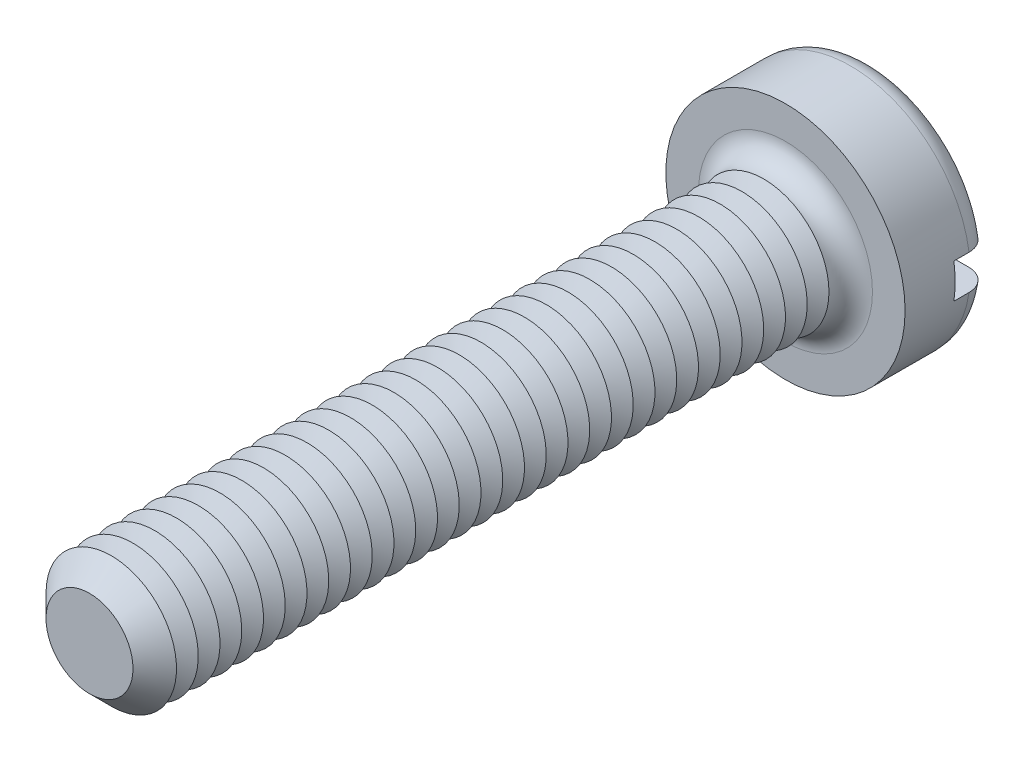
from build123d import *

# Parameters (mm, degrees)
SKETCH3_R           = 2.75
BOSS_EXTRUDE2_DEPTH = 2
SKETCH4_R           = 1.5
BOSS_EXTRUDE3_DEPTH = 16
FILLET1_R           = 0.5
CHAMFER1_SIZE       = 0.5
LPATTERN1_COUNT     = 30
LPATTERN1_PITCH     = 0.5
SKETCH8_W           = 5.5
SKETCH8_H           = 0.8
CUT_EXTRUDE1_DEPTH  = 0.85


with BuildPart() as part:
    # Sketch3 → Boss-Extrude2 (new body)
    with BuildSketch(Plane.XY):
        Circle(SKETCH3_R)
    extrude(amount=-BOSS_EXTRUDE2_DEPTH)

    # Sketch4 → Boss-Extrude3 (add)
    with BuildSketch(Plane.XY):
        Circle(SKETCH4_R)
    extrude(amount=BOSS_EXTRUDE3_DEPTH)

    # Fillet1
    fillet1_edges = [part.edges().sort_by_distance(p)[0] for p in [
        (-2.75, 0, -2),
        (-1.5, 0, 0),
    ]]
    fillet(fillet1_edges, radius=FILLET1_R)

    # Chamfer1
    chamfer1_edges = [part.edges().sort_by_distance(p)[0] for p in [
        (-1.5, 0, 16),
    ]]
    chamfer(chamfer1_edges, length=CHAMFER1_SIZE)

    # Sketch6 → Cut-Revolve1 (revolve, cut)
    with BuildSketch(Plane(origin=(0, 0, 0), x_dir=(0, 0, -1), z_dir=(1, 0, 0)), mode=Mode.PRIVATE) as cut_revolve1_sk:
        Polygon((-0.5, 1.5), (-0.75, 1.066987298), (-1, 1.5), align=None)
    cut_revolve1 = revolve(cut_revolve1_sk.sketch.rotate(Axis((0, 0, -1.694361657), (0, 0, 1)), 90), axis=Axis((0, 0, -1.694361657), (0, 0, 1)), mode=Mode.SUBTRACT)

    # LPattern1: Cut-Revolve1 ×30
    with Locations(*[(0, 0, i * LPATTERN1_PITCH) for i in range(1, LPATTERN1_COUNT)]):
        add(cut_revolve1, mode=Mode.SUBTRACT)

    # Sketch8 → Cut-Extrude1 (cut)
    with BuildSketch(Plane(origin=(0, 0, -2), x_dir=(-1, 0, 0), z_dir=(0, 0, -1))):
        Rectangle(SKETCH8_W, SKETCH8_H)
    extrude(amount=-CUT_EXTRUDE1_DEPTH, mode=Mode.SUBTRACT)


solid = part.part
